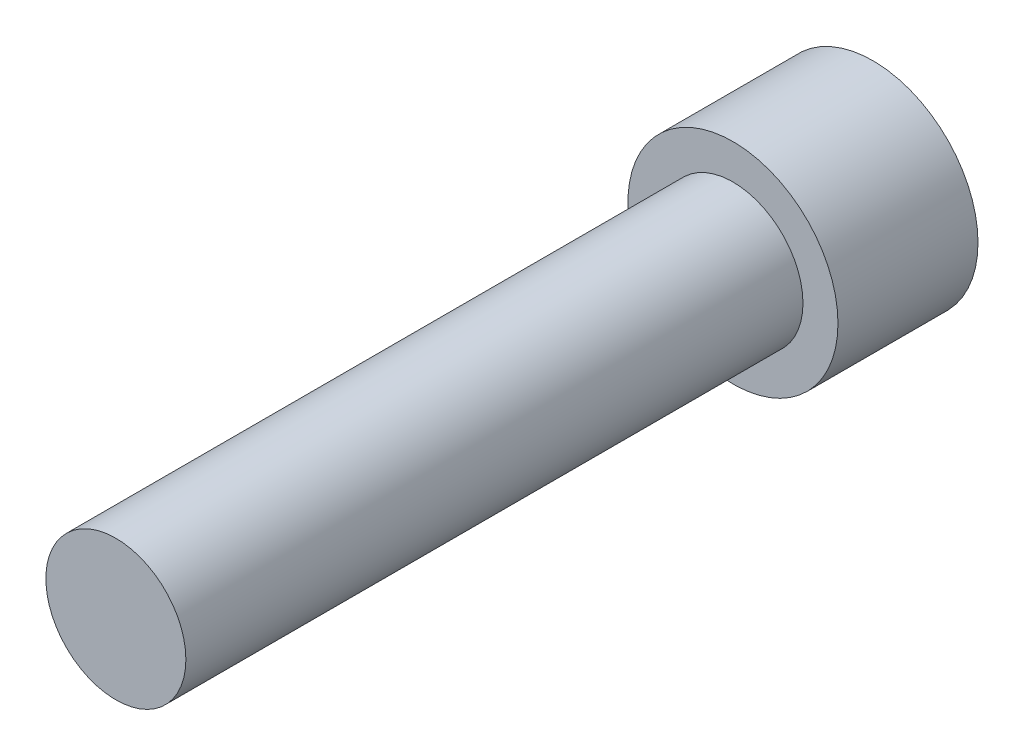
ISO-10303-21;
HEADER;
FILE_DESCRIPTION(('STEP AP214'),'2;1');
FILE_NAME('part.step','',(''),(''),'','','');
FILE_SCHEMA(('AUTOMOTIVE_DESIGN { 1 0 10303 214 1 1 1 1 }'));
ENDSEC;
DATA;
#1=APPLICATION_CONTEXT('core data for automotive mechanical design processes');
#2=APPLICATION_PROTOCOL_DEFINITION('international standard','automotive_design',2000,#1);
#3=PRODUCT_CONTEXT('',#1,'mechanical');
#4=PRODUCT('Part','Part','',(#3));
#5=PRODUCT_RELATED_PRODUCT_CATEGORY('part','',(#4));
#6=PRODUCT_DEFINITION_FORMATION('','',#4);
#7=PRODUCT_DEFINITION_CONTEXT('part definition',#1,'design');
#8=PRODUCT_DEFINITION('design','',#6,#7);
#9=PRODUCT_DEFINITION_SHAPE('','',#8);
#10=(LENGTH_UNIT() NAMED_UNIT(*) SI_UNIT(.MILLI.,.METRE.));
#11=(NAMED_UNIT(*) PLANE_ANGLE_UNIT() SI_UNIT($,.RADIAN.));
#12=(NAMED_UNIT(*) SI_UNIT($,.STERADIAN.) SOLID_ANGLE_UNIT());
#13=UNCERTAINTY_MEASURE_WITH_UNIT(LENGTH_MEASURE(1.E-05),#10,'distance_accuracy_value','');
#14=(GEOMETRIC_REPRESENTATION_CONTEXT(3) GLOBAL_UNCERTAINTY_ASSIGNED_CONTEXT((#13)) GLOBAL_UNIT_ASSIGNED_CONTEXT((#10,
#11,#12)) REPRESENTATION_CONTEXT('',''));
#15=CARTESIAN_POINT('',(0.,0.,0.));
#16=DIRECTION('',(0.,0.,1.));
#17=DIRECTION('',(1.,0.,0.));
#18=AXIS2_PLACEMENT_3D('',#15,#16,#17);
#19=CARTESIAN_POINT('',(0.,0.,34.925));
#20=DIRECTION('',(0.,0.,1.));
#21=DIRECTION('',(1.,0.,0.));
#22=AXIS2_PLACEMENT_3D('',#19,#20,#21);
#23=PLANE('',#22);
#24=CARTESIAN_POINT('',(0.,0.,34.925));
#25=DIRECTION('',(0.,0.,1.));
#26=DIRECTION('',(1.,0.,0.));
#27=AXIS2_PLACEMENT_3D('',#24,#25,#26);
#28=CIRCLE('',#27,3.9624);
#29=CARTESIAN_POINT('',(3.9624,0.,34.925));
#30=VERTEX_POINT('',#29);
#31=EDGE_CURVE('E11',#30,#30,#28,.T.);
#32=ORIENTED_EDGE('',*,*,#31,.T.);
#33=EDGE_LOOP('',(#32));
#34=FACE_BOUND('',#33,.T.);
#35=ADVANCED_FACE('F33',(#34),#23,.T.);
#36=CARTESIAN_POINT('',(0.,0.,34.925));
#37=DIRECTION('',(0.,0.,1.));
#38=DIRECTION('',(1.,0.,0.));
#39=AXIS2_PLACEMENT_3D('',#36,#37,#38);
#40=CYLINDRICAL_SURFACE('',#39,3.9624);
#41=CARTESIAN_POINT('',(0.,0.,0.));
#42=DIRECTION('',(0.,0.,1.));
#43=DIRECTION('',(1.,0.,0.));
#44=AXIS2_PLACEMENT_3D('',#41,#42,#43);
#45=CIRCLE('',#44,3.9624);
#46=CARTESIAN_POINT('',(3.9624,0.,0.));
#47=VERTEX_POINT('',#46);
#48=EDGE_CURVE('E40',#47,#47,#45,.T.);
#49=ORIENTED_EDGE('',*,*,#48,.T.);
#50=EDGE_LOOP('',(#49));
#51=FACE_BOUND('',#50,.T.);
#52=ORIENTED_EDGE('',*,*,#31,.F.);
#53=EDGE_LOOP('',(#52));
#54=FACE_BOUND('',#53,.T.);
#55=ADVANCED_FACE('F147',(#51,#54),#40,.T.);
#56=CARTESIAN_POINT('',(0.,-3.9624,0.));
#57=DIRECTION('',(0.,0.,1.));
#58=DIRECTION('',(1.,0.,0.));
#59=AXIS2_PLACEMENT_3D('',#56,#57,#58);
#60=PLANE('',#59);
#61=CARTESIAN_POINT('',(0.,0.,0.));
#62=DIRECTION('',(0.,0.,1.));
#63=DIRECTION('',(1.,0.,0.));
#64=AXIS2_PLACEMENT_3D('',#61,#62,#63);
#65=CIRCLE('',#64,5.9436);
#66=CARTESIAN_POINT('',(5.9436,0.,0.));
#67=VERTEX_POINT('',#66);
#68=EDGE_CURVE('E142',#67,#67,#65,.T.);
#69=ORIENTED_EDGE('',*,*,#68,.T.);
#70=EDGE_LOOP('',(#69));
#71=FACE_BOUND('',#70,.T.);
#72=ORIENTED_EDGE('',*,*,#48,.F.);
#73=EDGE_LOOP('',(#72));
#74=FACE_BOUND('',#73,.T.);
#75=ADVANCED_FACE('F150',(#71,#74),#60,.T.);
#76=CARTESIAN_POINT('',(0.,0.,34.925));
#77=DIRECTION('',(0.,0.,1.));
#78=DIRECTION('',(1.,0.,0.));
#79=AXIS2_PLACEMENT_3D('',#76,#77,#78);
#80=CYLINDRICAL_SURFACE('',#79,5.9436);
#81=CARTESIAN_POINT('',(0.,0.,-7.9248));
#82=DIRECTION('',(0.,0.,1.));
#83=DIRECTION('',(1.,0.,0.));
#84=AXIS2_PLACEMENT_3D('',#81,#82,#83);
#85=CIRCLE('',#84,5.9436);
#86=CARTESIAN_POINT('',(5.9436,0.,-7.9248));
#87=VERTEX_POINT('',#86);
#88=EDGE_CURVE('E134',#87,#87,#85,.T.);
#89=ORIENTED_EDGE('',*,*,#88,.T.);
#90=EDGE_LOOP('',(#89));
#91=FACE_BOUND('',#90,.T.);
#92=ORIENTED_EDGE('',*,*,#68,.F.);
#93=EDGE_LOOP('',(#92));
#94=FACE_BOUND('',#93,.T.);
#95=ADVANCED_FACE('F152',(#91,#94),#80,.T.);
#96=CARTESIAN_POINT('',(0.,-5.9436,-7.9248));
#97=DIRECTION('',(0.,0.,-1.));
#98=DIRECTION('',(-1.,0.,0.));
#99=AXIS2_PLACEMENT_3D('',#96,#97,#98);
#100=PLANE('',#99);
#101=DIRECTION('',(0.866025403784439,-0.5,0.));
#102=VECTOR('',#101,1.);
#103=CARTESIAN_POINT('',(0.,3.66617420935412,-7.9248));
#104=LINE('',#103,#102);
#105=CARTESIAN_POINT('',(0.,3.66617420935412,-7.9248));
#106=VERTEX_POINT('',#105);
#107=CARTESIAN_POINT('',(3.175,1.83308710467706,-7.9248));
#108=VERTEX_POINT('',#107);
#109=EDGE_CURVE('E47',#106,#108,#104,.T.);
#110=ORIENTED_EDGE('',*,*,#109,.F.);
#111=DIRECTION('',(0.866025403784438,0.5,0.));
#112=VECTOR('',#111,1.);
#113=CARTESIAN_POINT('',(-3.175,1.83308710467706,-7.9248));
#114=LINE('',#113,#112);
#115=CARTESIAN_POINT('',(-3.175,1.83308710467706,-7.9248));
#116=VERTEX_POINT('',#115);
#117=EDGE_CURVE('E130',#116,#106,#114,.T.);
#118=ORIENTED_EDGE('',*,*,#117,.F.);
#119=DIRECTION('',(0.,1.,0.));
#120=VECTOR('',#119,1.);
#121=CARTESIAN_POINT('',(-3.175,-1.83308710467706,-7.9248));
#122=LINE('',#121,#120);
#123=CARTESIAN_POINT('',(-3.175,-1.83308710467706,-7.9248));
#124=VERTEX_POINT('',#123);
#125=EDGE_CURVE('E128',#124,#116,#122,.T.);
#126=ORIENTED_EDGE('',*,*,#125,.F.);
#127=DIRECTION('',(-0.866025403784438,0.5,0.));
#128=VECTOR('',#127,1.);
#129=CARTESIAN_POINT('',(0.,-3.66617420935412,-7.9248));
#130=LINE('',#129,#128);
#131=CARTESIAN_POINT('',(0.,-3.66617420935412,-7.9248));
#132=VERTEX_POINT('',#131);
#133=EDGE_CURVE('E95',#132,#124,#130,.T.);
#134=ORIENTED_EDGE('',*,*,#133,.F.);
#135=DIRECTION('',(-0.866025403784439,-0.5,0.));
#136=VECTOR('',#135,1.);
#137=CARTESIAN_POINT('',(3.175,-1.83308710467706,-7.9248));
#138=LINE('',#137,#136);
#139=CARTESIAN_POINT('',(3.175,-1.83308710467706,-7.9248));
#140=VERTEX_POINT('',#139);
#141=EDGE_CURVE('E124',#140,#132,#138,.T.);
#142=ORIENTED_EDGE('',*,*,#141,.F.);
#143=DIRECTION('',(0.,-1.,0.));
#144=VECTOR('',#143,1.);
#145=CARTESIAN_POINT('',(3.175,1.83308710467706,-7.9248));
#146=LINE('',#145,#144);
#147=EDGE_CURVE('E121',#108,#140,#146,.T.);
#148=ORIENTED_EDGE('',*,*,#147,.F.);
#149=EDGE_LOOP('',(#110,#118,#126,#134,#142,#148));
#150=FACE_BOUND('',#149,.T.);
#151=ORIENTED_EDGE('',*,*,#88,.F.);
#152=EDGE_LOOP('',(#151));
#153=FACE_BOUND('',#152,.T.);
#154=ADVANCED_FACE('F159',(#150,#153),#100,.T.);
#155=CARTESIAN_POINT('',(0.,3.66617420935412,-3.0988));
#156=DIRECTION('',(0.5,0.866025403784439,0.));
#157=DIRECTION('',(-0.866025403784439,0.5,0.));
#158=AXIS2_PLACEMENT_3D('',#155,#156,#157);
#159=PLANE('',#158);
#160=ORIENTED_EDGE('',*,*,#109,.T.);
#161=DIRECTION('',(0.,0.,-1.));
#162=VECTOR('',#161,1.);
#163=CARTESIAN_POINT('',(3.175,1.83308710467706,-3.0988));
#164=LINE('',#163,#162);
#165=CARTESIAN_POINT('',(3.175,1.83308710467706,-3.0988));
#166=VERTEX_POINT('',#165);
#167=EDGE_CURVE('E77',#166,#108,#164,.T.);
#168=ORIENTED_EDGE('',*,*,#167,.F.);
#169=DIRECTION('',(0.866025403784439,-0.5,0.));
#170=VECTOR('',#169,1.);
#171=CARTESIAN_POINT('',(0.,3.66617420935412,-3.0988));
#172=LINE('',#171,#170);
#173=CARTESIAN_POINT('',(0.,3.66617420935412,-3.0988));
#174=VERTEX_POINT('',#173);
#175=EDGE_CURVE('E132',#174,#166,#172,.T.);
#176=ORIENTED_EDGE('',*,*,#175,.F.);
#177=DIRECTION('',(0.,0.,-1.));
#178=VECTOR('',#177,1.);
#179=CARTESIAN_POINT('',(0.,3.66617420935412,-3.0988));
#180=LINE('',#179,#178);
#181=EDGE_CURVE('E55',#174,#106,#180,.T.);
#182=ORIENTED_EDGE('',*,*,#181,.T.);
#183=EDGE_LOOP('',(#160,#168,#176,#182));
#184=FACE_BOUND('',#183,.T.);
#185=ADVANCED_FACE('F190',(#184),#159,.F.);
#186=CARTESIAN_POINT('',(-3.175,1.83308710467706,-3.0988));
#187=DIRECTION('',(-0.5,0.866025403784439,0.));
#188=DIRECTION('',(-0.866025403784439,-0.5,0.));
#189=AXIS2_PLACEMENT_3D('',#186,#187,#188);
#190=PLANE('',#189);
#191=ORIENTED_EDGE('',*,*,#117,.T.);
#192=ORIENTED_EDGE('',*,*,#181,.F.);
#193=DIRECTION('',(0.866025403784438,0.5,0.));
#194=VECTOR('',#193,1.);
#195=CARTESIAN_POINT('',(-3.175,1.83308710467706,-3.0988));
#196=LINE('',#195,#194);
#197=CARTESIAN_POINT('',(-3.175,1.83308710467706,-3.0988));
#198=VERTEX_POINT('',#197);
#199=EDGE_CURVE('E107',#198,#174,#196,.T.);
#200=ORIENTED_EDGE('',*,*,#199,.F.);
#201=DIRECTION('',(0.,0.,-1.));
#202=VECTOR('',#201,1.);
#203=CARTESIAN_POINT('',(-3.175,1.83308710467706,-3.0988));
#204=LINE('',#203,#202);
#205=EDGE_CURVE('E99',#198,#116,#204,.T.);
#206=ORIENTED_EDGE('',*,*,#205,.T.);
#207=EDGE_LOOP('',(#191,#192,#200,#206));
#208=FACE_BOUND('',#207,.T.);
#209=ADVANCED_FACE('F200',(#208),#190,.F.);
#210=CARTESIAN_POINT('',(-3.175,-1.83308710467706,-3.0988));
#211=DIRECTION('',(-1.,0.,0.));
#212=DIRECTION('',(0.,-1.,0.));
#213=AXIS2_PLACEMENT_3D('',#210,#211,#212);
#214=PLANE('',#213);
#215=ORIENTED_EDGE('',*,*,#125,.T.);
#216=ORIENTED_EDGE('',*,*,#205,.F.);
#217=DIRECTION('',(0.,1.,0.));
#218=VECTOR('',#217,1.);
#219=CARTESIAN_POINT('',(-3.175,-1.83308710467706,-3.0988));
#220=LINE('',#219,#218);
#221=CARTESIAN_POINT('',(-3.175,-1.83308710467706,-3.0988));
#222=VERTEX_POINT('',#221);
#223=EDGE_CURVE('E103',#222,#198,#220,.T.);
#224=ORIENTED_EDGE('',*,*,#223,.F.);
#225=DIRECTION('',(0.,0.,-1.));
#226=VECTOR('',#225,1.);
#227=CARTESIAN_POINT('',(-3.175,-1.83308710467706,-3.0988));
#228=LINE('',#227,#226);
#229=EDGE_CURVE('E88',#222,#124,#228,.T.);
#230=ORIENTED_EDGE('',*,*,#229,.T.);
#231=EDGE_LOOP('',(#215,#216,#224,#230));
#232=FACE_BOUND('',#231,.T.);
#233=ADVANCED_FACE('F104',(#232),#214,.F.);
#234=CARTESIAN_POINT('',(0.,-3.66617420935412,-3.0988));
#235=DIRECTION('',(-0.5,-0.866025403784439,0.));
#236=DIRECTION('',(0.866025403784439,-0.5,0.));
#237=AXIS2_PLACEMENT_3D('',#234,#235,#236);
#238=PLANE('',#237);
#239=ORIENTED_EDGE('',*,*,#133,.T.);
#240=ORIENTED_EDGE('',*,*,#229,.F.);
#241=DIRECTION('',(-0.866025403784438,0.5,0.));
#242=VECTOR('',#241,1.);
#243=CARTESIAN_POINT('',(0.,-3.66617420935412,-3.0988));
#244=LINE('',#243,#242);
#245=CARTESIAN_POINT('',(0.,-3.66617420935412,-3.0988));
#246=VERTEX_POINT('',#245);
#247=EDGE_CURVE('E92',#246,#222,#244,.T.);
#248=ORIENTED_EDGE('',*,*,#247,.F.);
#249=DIRECTION('',(0.,0.,-1.));
#250=VECTOR('',#249,1.);
#251=CARTESIAN_POINT('',(0.,-3.66617420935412,-3.0988));
#252=LINE('',#251,#250);
#253=EDGE_CURVE('E100',#246,#132,#252,.T.);
#254=ORIENTED_EDGE('',*,*,#253,.T.);
#255=EDGE_LOOP('',(#239,#240,#248,#254));
#256=FACE_BOUND('',#255,.T.);
#257=ADVANCED_FACE('F90',(#256),#238,.F.);
#258=CARTESIAN_POINT('',(3.175,-1.83308710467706,-3.0988));
#259=DIRECTION('',(0.5,-0.866025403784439,0.));
#260=DIRECTION('',(0.866025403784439,0.5,0.));
#261=AXIS2_PLACEMENT_3D('',#258,#259,#260);
#262=PLANE('',#261);
#263=ORIENTED_EDGE('',*,*,#141,.T.);
#264=ORIENTED_EDGE('',*,*,#253,.F.);
#265=DIRECTION('',(-0.866025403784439,-0.5,0.));
#266=VECTOR('',#265,1.);
#267=CARTESIAN_POINT('',(3.175,-1.83308710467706,-3.0988));
#268=LINE('',#267,#266);
#269=CARTESIAN_POINT('',(3.175,-1.83308710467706,-3.0988));
#270=VERTEX_POINT('',#269);
#271=EDGE_CURVE('E113',#270,#246,#268,.T.);
#272=ORIENTED_EDGE('',*,*,#271,.F.);
#273=DIRECTION('',(0.,0.,-1.));
#274=VECTOR('',#273,1.);
#275=CARTESIAN_POINT('',(3.175,-1.83308710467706,-3.0988));
#276=LINE('',#275,#274);
#277=EDGE_CURVE('E137',#270,#140,#276,.T.);
#278=ORIENTED_EDGE('',*,*,#277,.T.);
#279=EDGE_LOOP('',(#263,#264,#272,#278));
#280=FACE_BOUND('',#279,.T.);
#281=ADVANCED_FACE('F225',(#280),#262,.F.);
#282=CARTESIAN_POINT('',(3.175,1.83308710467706,-3.0988));
#283=DIRECTION('',(1.,0.,0.));
#284=DIRECTION('',(0.,0.,-1.));
#285=AXIS2_PLACEMENT_3D('',#282,#283,#284);
#286=PLANE('',#285);
#287=ORIENTED_EDGE('',*,*,#147,.T.);
#288=ORIENTED_EDGE('',*,*,#277,.F.);
#289=DIRECTION('',(0.,-1.,0.));
#290=VECTOR('',#289,1.);
#291=CARTESIAN_POINT('',(3.175,1.83308710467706,-3.0988));
#292=LINE('',#291,#290);
#293=EDGE_CURVE('E115',#166,#270,#292,.T.);
#294=ORIENTED_EDGE('',*,*,#293,.F.);
#295=ORIENTED_EDGE('',*,*,#167,.T.);
#296=EDGE_LOOP('',(#287,#288,#294,#295));
#297=FACE_BOUND('',#296,.T.);
#298=ADVANCED_FACE('F234',(#297),#286,.F.);
#299=CARTESIAN_POINT('',(0.,3.66617420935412,-3.0988));
#300=DIRECTION('',(0.,0.,1.));
#301=DIRECTION('',(1.,0.,0.));
#302=AXIS2_PLACEMENT_3D('',#299,#300,#301);
#303=PLANE('',#302);
#304=ORIENTED_EDGE('',*,*,#175,.T.);
#305=ORIENTED_EDGE('',*,*,#293,.T.);
#306=ORIENTED_EDGE('',*,*,#271,.T.);
#307=ORIENTED_EDGE('',*,*,#247,.T.);
#308=ORIENTED_EDGE('',*,*,#223,.T.);
#309=ORIENTED_EDGE('',*,*,#199,.T.);
#310=EDGE_LOOP('',(#304,#305,#306,#307,#308,#309));
#311=FACE_BOUND('',#310,.T.);
#312=ADVANCED_FACE('F110',(#311),#303,.F.);
#313=CLOSED_SHELL('',(#35,#55,#75,#95,#154,#185,#209,#233,#257,#281,#298,#312));
#314=MANIFOLD_SOLID_BREP('B2',#313);
#315=ADVANCED_BREP_SHAPE_REPRESENTATION('',(#18,#314),#14);
#316=SHAPE_DEFINITION_REPRESENTATION(#9,#315);
ENDSEC;
END-ISO-10303-21;
